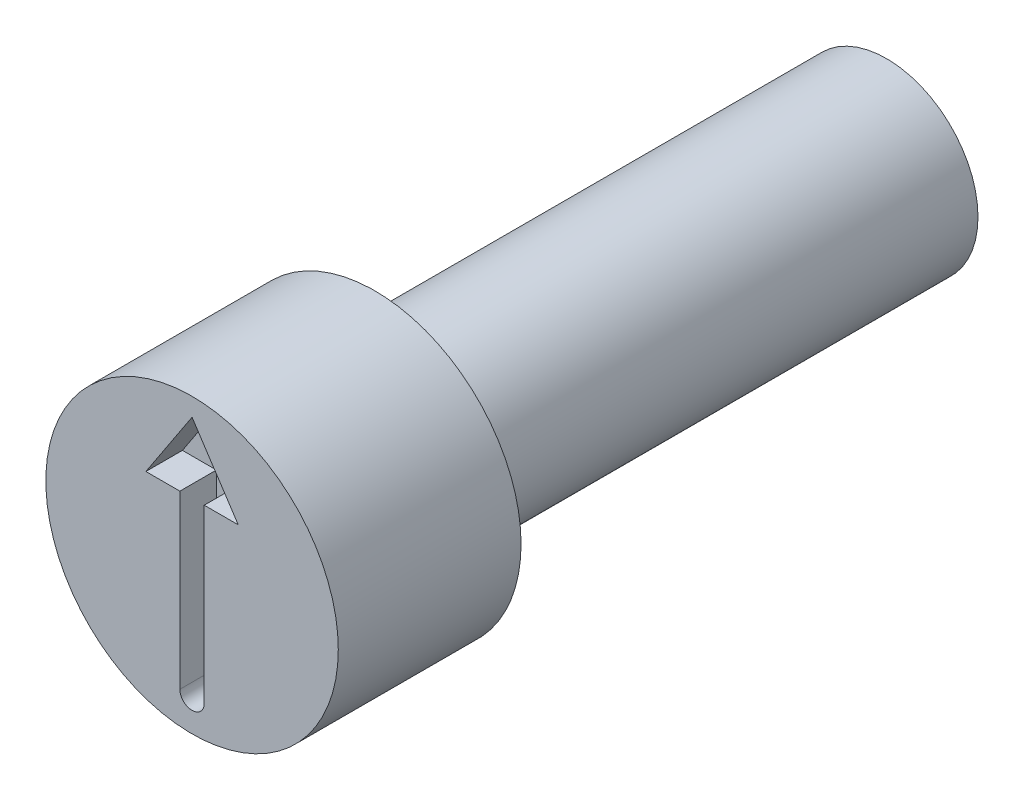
from build123d import *

# Parameters (mm, degrees)
CUT_EXTRUDE4_DEPTH = 0.2


with BuildPart() as part:
    # Sketch2 → Revolve1 (revolve)
    with BuildSketch(Plane(origin=(0, 0, 0), x_dir=(0, 0, -1), z_dir=(1, 0, 0)), mode=Mode.PRIVATE) as revolve1_sk:
        Polygon((0, 0.8), (0, 0), (3.8, 0), (3.8, 0.5), (1, 0.5), (1, 0.8), align=None)
    revolve(revolve1_sk.sketch.rotate(Axis((0, 0, -0.403888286), (0, 0, -1)), 90), axis=Axis((0, 0, -0.403888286), (0, 0, -1)))

    # Sketch3 → Cut-Extrude4 (cut)
    with BuildSketch(Plane.XY):
        with BuildLine():
            Line((0.066665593, 0.317223), (0.066665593, -0.621656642))
            ThreePointArc((0.066665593, -0.621656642), (0, -0.688322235), (-0.066665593, -0.621656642))
            Line((-0.066665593, -0.621656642), (-0.066665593, 0.317223))
            Line((-0.066665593, 0.317223), (-0.252671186, 0.317223))
            Line((-0.252671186, 0.317223), (0, 0.700740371))
            Line((0, 0.700740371), (0.252671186, 0.317223))
            Line((0.252671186, 0.317223), (0.066665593, 0.317223))
        make_face()
    extrude(amount=-CUT_EXTRUDE4_DEPTH, mode=Mode.SUBTRACT)


solid = part.part
